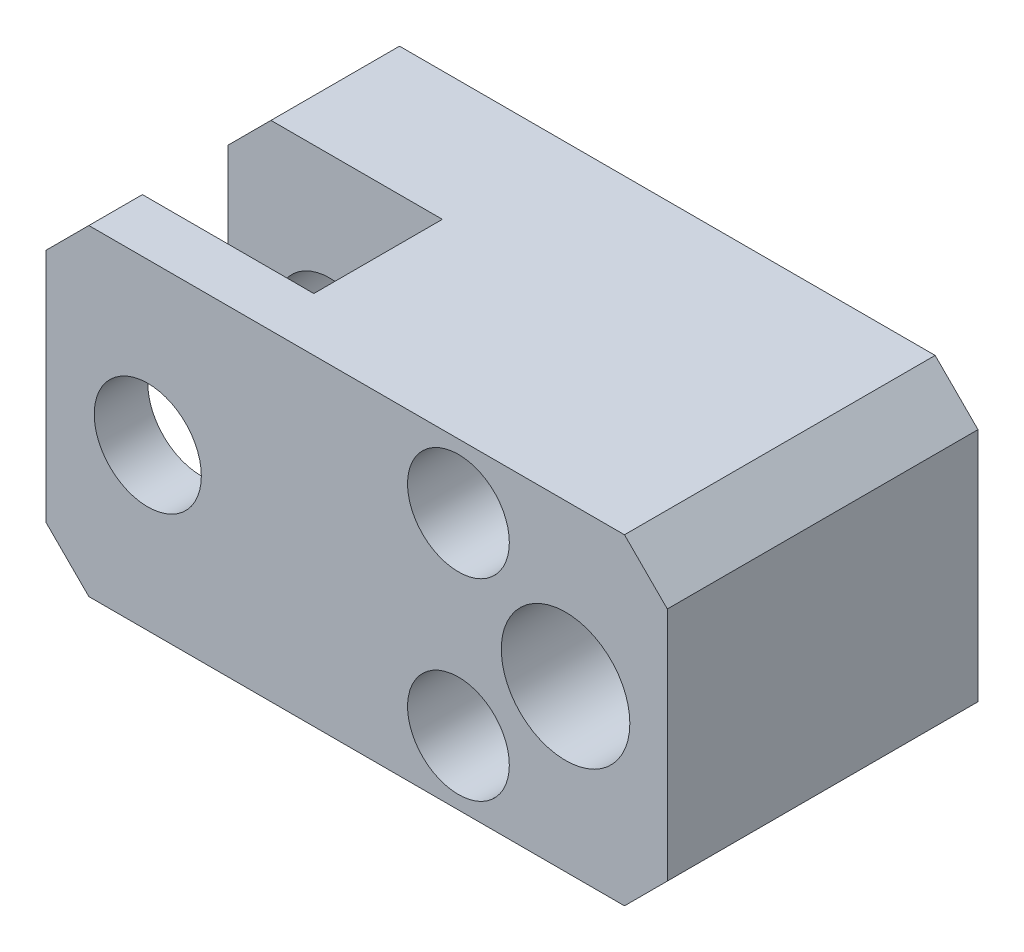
ISO-10303-21;
HEADER;
FILE_DESCRIPTION(('STEP AP214'),'2;1');
FILE_NAME('part.step','',(''),(''),'','','');
FILE_SCHEMA(('AUTOMOTIVE_DESIGN { 1 0 10303 214 1 1 1 1 }'));
ENDSEC;
DATA;
#1=APPLICATION_CONTEXT('core data for automotive mechanical design processes');
#2=APPLICATION_PROTOCOL_DEFINITION('international standard','automotive_design',2000,#1);
#3=PRODUCT_CONTEXT('',#1,'mechanical');
#4=PRODUCT('Part','Part','',(#3));
#5=PRODUCT_RELATED_PRODUCT_CATEGORY('part','',(#4));
#6=PRODUCT_DEFINITION_FORMATION('','',#4);
#7=PRODUCT_DEFINITION_CONTEXT('part definition',#1,'design');
#8=PRODUCT_DEFINITION('design','',#6,#7);
#9=PRODUCT_DEFINITION_SHAPE('','',#8);
#10=(LENGTH_UNIT() NAMED_UNIT(*) SI_UNIT(.MILLI.,.METRE.));
#11=(NAMED_UNIT(*) PLANE_ANGLE_UNIT() SI_UNIT($,.RADIAN.));
#12=(NAMED_UNIT(*) SI_UNIT($,.STERADIAN.) SOLID_ANGLE_UNIT());
#13=UNCERTAINTY_MEASURE_WITH_UNIT(LENGTH_MEASURE(1.E-05),#10,'distance_accuracy_value','');
#14=(GEOMETRIC_REPRESENTATION_CONTEXT(3) GLOBAL_UNCERTAINTY_ASSIGNED_CONTEXT((#13)) GLOBAL_UNIT_ASSIGNED_CONTEXT((#10,
#11,#12)) REPRESENTATION_CONTEXT('',''));
#15=CARTESIAN_POINT('',(0.,0.,0.));
#16=DIRECTION('',(0.,0.,1.));
#17=DIRECTION('',(1.,0.,0.));
#18=AXIS2_PLACEMENT_3D('',#15,#16,#17);
#19=CARTESIAN_POINT('',(-18.5,24.,24.));
#20=DIRECTION('',(1.,0.,0.));
#21=DIRECTION('',(0.,1.,0.));
#22=AXIS2_PLACEMENT_3D('',#19,#20,#21);
#23=PLANE('',#22);
#24=DIRECTION('',(0.,0.,1.));
#25=VECTOR('',#24,1.);
#26=CARTESIAN_POINT('',(-18.5,-6.,24.));
#27=LINE('',#26,#25);
#28=CARTESIAN_POINT('',(-18.5,-6.,12.));
#29=VERTEX_POINT('',#28);
#30=CARTESIAN_POINT('',(-18.5,-6.,24.));
#31=VERTEX_POINT('',#30);
#32=EDGE_CURVE('E129',#29,#31,#27,.T.);
#33=ORIENTED_EDGE('',*,*,#32,.T.);
#34=DIRECTION('',(0.,-1.,0.));
#35=VECTOR('',#34,1.);
#36=CARTESIAN_POINT('',(-18.5,24.,24.));
#37=LINE('',#36,#35);
#38=CARTESIAN_POINT('',(-18.5,24.,24.));
#39=VERTEX_POINT('',#38);
#40=EDGE_CURVE('E137',#39,#31,#37,.T.);
#41=ORIENTED_EDGE('',*,*,#40,.F.);
#42=DIRECTION('',(0.,0.,1.));
#43=VECTOR('',#42,1.);
#44=CARTESIAN_POINT('',(-18.5,24.,24.));
#45=LINE('',#44,#43);
#46=CARTESIAN_POINT('',(-18.5,24.,12.));
#47=VERTEX_POINT('',#46);
#48=EDGE_CURVE('E136',#47,#39,#45,.T.);
#49=ORIENTED_EDGE('',*,*,#48,.F.);
#50=DIRECTION('',(0.,-1.,0.));
#51=VECTOR('',#50,1.);
#52=CARTESIAN_POINT('',(-18.5,24.,12.));
#53=LINE('',#52,#51);
#54=EDGE_CURVE('E121',#47,#29,#53,.T.);
#55=ORIENTED_EDGE('',*,*,#54,.T.);
#56=EDGE_LOOP('',(#33,#41,#49,#55));
#57=FACE_BOUND('',#56,.T.);
#58=ADVANCED_FACE('F14',(#57),#23,.F.);
#59=CARTESIAN_POINT('',(-38.5,24.,0.));
#60=DIRECTION('',(-1.,0.,0.));
#61=DIRECTION('',(0.,-1.,0.));
#62=AXIS2_PLACEMENT_3D('',#59,#60,#61);
#63=PLANE('',#62);
#64=DIRECTION('',(0.,-1.,0.));
#65=VECTOR('',#64,1.);
#66=CARTESIAN_POINT('',(-38.5,-6.,29.));
#67=LINE('',#66,#65);
#68=CARTESIAN_POINT('',(-38.5,20.,29.));
#69=VERTEX_POINT('',#68);
#70=CARTESIAN_POINT('',(-38.5,-2.,29.));
#71=VERTEX_POINT('',#70);
#72=EDGE_CURVE('E164',#69,#71,#67,.T.);
#73=ORIENTED_EDGE('',*,*,#72,.F.);
#74=DIRECTION('',(0.,0.,-1.));
#75=VECTOR('',#74,1.);
#76=CARTESIAN_POINT('',(-38.5,20.,24.));
#77=LINE('',#76,#75);
#78=CARTESIAN_POINT('',(-38.5,20.,24.));
#79=VERTEX_POINT('',#78);
#80=EDGE_CURVE('E36',#69,#79,#77,.T.);
#81=ORIENTED_EDGE('',*,*,#80,.T.);
#82=DIRECTION('',(0.,-1.,0.));
#83=VECTOR('',#82,1.);
#84=CARTESIAN_POINT('',(-38.5,24.,24.));
#85=LINE('',#84,#83);
#86=CARTESIAN_POINT('',(-38.5,-2.,24.));
#87=VERTEX_POINT('',#86);
#88=EDGE_CURVE('E151',#79,#87,#85,.T.);
#89=ORIENTED_EDGE('',*,*,#88,.T.);
#90=DIRECTION('',(0.,0.,1.));
#91=VECTOR('',#90,1.);
#92=CARTESIAN_POINT('',(-38.5,-2.,29.));
#93=LINE('',#92,#91);
#94=EDGE_CURVE('E227',#87,#71,#93,.T.);
#95=ORIENTED_EDGE('',*,*,#94,.T.);
#96=EDGE_LOOP('',(#73,#81,#89,#95));
#97=FACE_BOUND('',#96,.T.);
#98=ADVANCED_FACE('F281',(#97),#63,.T.);
#99=CARTESIAN_POINT('',(19.5,-6.,0.));
#100=DIRECTION('',(0.,0.,1.));
#101=DIRECTION('',(1.,0.,0.));
#102=AXIS2_PLACEMENT_3D('',#99,#100,#101);
#103=PLANE('',#102);
#104=CARTESIAN_POINT('',(0.,18.,0.));
#105=DIRECTION('',(0.,0.,1.));
#106=DIRECTION('',(1.,0.,0.));
#107=AXIS2_PLACEMENT_3D('',#104,#105,#106);
#108=CIRCLE('',#107,2.75);
#109=CARTESIAN_POINT('',(2.75,18.,0.));
#110=VERTEX_POINT('',#109);
#111=EDGE_CURVE('E361',#110,#110,#108,.T.);
#112=ORIENTED_EDGE('',*,*,#111,.T.);
#113=EDGE_LOOP('',(#112));
#114=FACE_BOUND('',#113,.T.);
#115=CARTESIAN_POINT('',(0.,0.,0.));
#116=DIRECTION('',(0.,0.,1.));
#117=DIRECTION('',(1.,0.,0.));
#118=AXIS2_PLACEMENT_3D('',#115,#116,#117);
#119=CIRCLE('',#118,2.75);
#120=CARTESIAN_POINT('',(2.75,0.,0.));
#121=VERTEX_POINT('',#120);
#122=EDGE_CURVE('E349',#121,#121,#119,.T.);
#123=ORIENTED_EDGE('',*,*,#122,.T.);
#124=EDGE_LOOP('',(#123));
#125=FACE_BOUND('',#124,.T.);
#126=DIRECTION('',(-1.,0.,0.));
#127=VECTOR('',#126,1.);
#128=CARTESIAN_POINT('',(19.5,-6.,0.));
#129=LINE('',#128,#127);
#130=CARTESIAN_POINT('',(15.5,-6.,0.));
#131=VERTEX_POINT('',#130);
#132=CARTESIAN_POINT('',(-34.5,-6.,0.));
#133=VERTEX_POINT('',#132);
#134=EDGE_CURVE('E173',#131,#133,#129,.T.);
#135=ORIENTED_EDGE('',*,*,#134,.T.);
#136=DIRECTION('',(-0.707106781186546,0.707106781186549,0.));
#137=VECTOR('',#136,1.);
#138=CARTESIAN_POINT('',(-34.5,-6.,0.));
#139=LINE('',#138,#137);
#140=CARTESIAN_POINT('',(-38.5,-2.,0.));
#141=VERTEX_POINT('',#140);
#142=EDGE_CURVE('E202',#133,#141,#139,.T.);
#143=ORIENTED_EDGE('',*,*,#142,.T.);
#144=DIRECTION('',(0.,1.,0.));
#145=VECTOR('',#144,1.);
#146=CARTESIAN_POINT('',(-38.5,-6.,0.));
#147=LINE('',#146,#145);
#148=CARTESIAN_POINT('',(-38.5,20.,0.));
#149=VERTEX_POINT('',#148);
#150=EDGE_CURVE('E161',#141,#149,#147,.T.);
#151=ORIENTED_EDGE('',*,*,#150,.T.);
#152=DIRECTION('',(0.707106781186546,0.707106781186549,0.));
#153=VECTOR('',#152,1.);
#154=CARTESIAN_POINT('',(-34.5,24.,0.));
#155=LINE('',#154,#153);
#156=CARTESIAN_POINT('',(-34.5,24.,0.));
#157=VERTEX_POINT('',#156);
#158=EDGE_CURVE('E200',#149,#157,#155,.T.);
#159=ORIENTED_EDGE('',*,*,#158,.T.);
#160=DIRECTION('',(-1.,0.,0.));
#161=VECTOR('',#160,1.);
#162=CARTESIAN_POINT('',(19.5,24.,0.));
#163=LINE('',#162,#161);
#164=CARTESIAN_POINT('',(15.5,24.,0.));
#165=VERTEX_POINT('',#164);
#166=EDGE_CURVE('E182',#165,#157,#163,.T.);
#167=ORIENTED_EDGE('',*,*,#166,.F.);
#168=DIRECTION('',(-0.707106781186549,0.707106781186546,0.));
#169=VECTOR('',#168,1.);
#170=CARTESIAN_POINT('',(19.5,20.,0.));
#171=LINE('',#170,#169);
#172=CARTESIAN_POINT('',(19.5,20.,0.));
#173=VERTEX_POINT('',#172);
#174=EDGE_CURVE('E198',#165,#173,#171,.F.);
#175=ORIENTED_EDGE('',*,*,#174,.T.);
#176=DIRECTION('',(0.,1.,0.));
#177=VECTOR('',#176,1.);
#178=CARTESIAN_POINT('',(19.5,-6.,0.));
#179=LINE('',#178,#177);
#180=CARTESIAN_POINT('',(19.5,-2.,0.));
#181=VERTEX_POINT('',#180);
#182=EDGE_CURVE('E167',#181,#173,#179,.T.);
#183=ORIENTED_EDGE('',*,*,#182,.F.);
#184=DIRECTION('',(0.707106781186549,0.707106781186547,0.));
#185=VECTOR('',#184,1.);
#186=CARTESIAN_POINT('',(19.5,-2.,0.));
#187=LINE('',#186,#185);
#188=EDGE_CURVE('E196',#181,#131,#187,.F.);
#189=ORIENTED_EDGE('',*,*,#188,.T.);
#190=EDGE_LOOP('',(#135,#143,#151,#159,#167,#175,#183,#189));
#191=FACE_BOUND('',#190,.T.);
#192=ADVANCED_FACE('F16',(#114,#125,#191),#103,.F.);
#193=CARTESIAN_POINT('',(19.5,24.,29.));
#194=DIRECTION('',(0.,-1.,0.));
#195=DIRECTION('',(0.,0.,-1.));
#196=AXIS2_PLACEMENT_3D('',#193,#194,#195);
#197=PLANE('',#196);
#198=ORIENTED_EDGE('',*,*,#166,.T.);
#199=DIRECTION('',(0.,0.,1.));
#200=VECTOR('',#199,1.);
#201=CARTESIAN_POINT('',(-34.5,24.,12.));
#202=LINE('',#201,#200);
#203=CARTESIAN_POINT('',(-34.5,24.,12.));
#204=VERTEX_POINT('',#203);
#205=EDGE_CURVE('E216',#157,#204,#202,.T.);
#206=ORIENTED_EDGE('',*,*,#205,.T.);
#207=DIRECTION('',(1.,0.,0.));
#208=VECTOR('',#207,1.);
#209=CARTESIAN_POINT('',(-38.5,24.,12.));
#210=LINE('',#209,#208);
#211=EDGE_CURVE('E145',#204,#47,#210,.T.);
#212=ORIENTED_EDGE('',*,*,#211,.T.);
#213=ORIENTED_EDGE('',*,*,#48,.T.);
#214=DIRECTION('',(-1.,0.,0.));
#215=VECTOR('',#214,1.);
#216=CARTESIAN_POINT('',(-38.5,24.,24.));
#217=LINE('',#216,#215);
#218=CARTESIAN_POINT('',(-34.5,24.,24.));
#219=VERTEX_POINT('',#218);
#220=EDGE_CURVE('E142',#39,#219,#217,.T.);
#221=ORIENTED_EDGE('',*,*,#220,.T.);
#222=DIRECTION('',(0.,0.,1.));
#223=VECTOR('',#222,1.);
#224=CARTESIAN_POINT('',(-34.5,24.,29.));
#225=LINE('',#224,#223);
#226=CARTESIAN_POINT('',(-34.5,24.,29.));
#227=VERTEX_POINT('',#226);
#228=EDGE_CURVE('E213',#219,#227,#225,.T.);
#229=ORIENTED_EDGE('',*,*,#228,.T.);
#230=DIRECTION('',(-1.,0.,0.));
#231=VECTOR('',#230,1.);
#232=CARTESIAN_POINT('',(19.5,24.,29.));
#233=LINE('',#232,#231);
#234=CARTESIAN_POINT('',(15.5,24.,29.));
#235=VERTEX_POINT('',#234);
#236=EDGE_CURVE('E179',#235,#227,#233,.T.);
#237=ORIENTED_EDGE('',*,*,#236,.F.);
#238=DIRECTION('',(0.,0.,-1.));
#239=VECTOR('',#238,1.);
#240=CARTESIAN_POINT('',(15.5,24.,29.));
#241=LINE('',#240,#239);
#242=EDGE_CURVE('E211',#235,#165,#241,.T.);
#243=ORIENTED_EDGE('',*,*,#242,.T.);
#244=EDGE_LOOP('',(#198,#206,#212,#213,#221,#229,#237,#243));
#245=FACE_BOUND('',#244,.T.);
#246=ADVANCED_FACE('F314',(#245),#197,.F.);
#247=CARTESIAN_POINT('',(19.5,-6.,29.));
#248=DIRECTION('',(0.,0.,-1.));
#249=DIRECTION('',(-1.,0.,0.));
#250=AXIS2_PLACEMENT_3D('',#247,#248,#249);
#251=PLANE('',#250);
#252=CARTESIAN_POINT('',(0.,18.,29.));
#253=DIRECTION('',(0.,0.,1.));
#254=DIRECTION('',(1.,0.,0.));
#255=AXIS2_PLACEMENT_3D('',#252,#253,#254);
#256=CIRCLE('',#255,4.75);
#257=CARTESIAN_POINT('',(4.75,18.,29.));
#258=VERTEX_POINT('',#257);
#259=EDGE_CURVE('E352',#258,#258,#256,.T.);
#260=ORIENTED_EDGE('',*,*,#259,.F.);
#261=EDGE_LOOP('',(#260));
#262=FACE_BOUND('',#261,.T.);
#263=CARTESIAN_POINT('',(0.,0.,29.));
#264=DIRECTION('',(0.,0.,1.));
#265=DIRECTION('',(1.,0.,0.));
#266=AXIS2_PLACEMENT_3D('',#263,#264,#265);
#267=CIRCLE('',#266,4.75);
#268=CARTESIAN_POINT('',(4.75,0.,29.));
#269=VERTEX_POINT('',#268);
#270=EDGE_CURVE('E340',#269,#269,#267,.T.);
#271=ORIENTED_EDGE('',*,*,#270,.F.);
#272=EDGE_LOOP('',(#271));
#273=FACE_BOUND('',#272,.T.);
#274=CARTESIAN_POINT('',(-29.,9.,29.));
#275=DIRECTION('',(0.,0.,1.));
#276=DIRECTION('',(1.,0.,0.));
#277=AXIS2_PLACEMENT_3D('',#274,#275,#276);
#278=CIRCLE('',#277,5.);
#279=CARTESIAN_POINT('',(-24.,9.,29.));
#280=VERTEX_POINT('',#279);
#281=EDGE_CURVE('E337',#280,#280,#278,.T.);
#282=ORIENTED_EDGE('',*,*,#281,.F.);
#283=EDGE_LOOP('',(#282));
#284=FACE_BOUND('',#283,.T.);
#285=CARTESIAN_POINT('',(10.,9.,29.));
#286=DIRECTION('',(0.,0.,1.));
#287=DIRECTION('',(1.,0.,0.));
#288=AXIS2_PLACEMENT_3D('',#285,#286,#287);
#289=CIRCLE('',#288,6.);
#290=CARTESIAN_POINT('',(16.,9.,29.));
#291=VERTEX_POINT('',#290);
#292=EDGE_CURVE('E152',#291,#291,#289,.T.);
#293=ORIENTED_EDGE('',*,*,#292,.F.);
#294=EDGE_LOOP('',(#293));
#295=FACE_BOUND('',#294,.T.);
#296=ORIENTED_EDGE('',*,*,#236,.T.);
#297=DIRECTION('',(-0.707106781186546,-0.707106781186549,0.));
#298=VECTOR('',#297,1.);
#299=CARTESIAN_POINT('',(-34.5,24.,29.));
#300=LINE('',#299,#298);
#301=EDGE_CURVE('E225',#227,#69,#300,.T.);
#302=ORIENTED_EDGE('',*,*,#301,.T.);
#303=ORIENTED_EDGE('',*,*,#72,.T.);
#304=DIRECTION('',(0.707106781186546,-0.707106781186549,0.));
#305=VECTOR('',#304,1.);
#306=CARTESIAN_POINT('',(-34.5,-6.,29.));
#307=LINE('',#306,#305);
#308=CARTESIAN_POINT('',(-34.5,-6.,29.));
#309=VERTEX_POINT('',#308);
#310=EDGE_CURVE('E223',#71,#309,#307,.T.);
#311=ORIENTED_EDGE('',*,*,#310,.T.);
#312=DIRECTION('',(-1.,0.,0.));
#313=VECTOR('',#312,1.);
#314=CARTESIAN_POINT('',(19.5,-6.,29.));
#315=LINE('',#314,#313);
#316=CARTESIAN_POINT('',(15.5,-6.,29.));
#317=VERTEX_POINT('',#316);
#318=EDGE_CURVE('E176',#317,#309,#315,.T.);
#319=ORIENTED_EDGE('',*,*,#318,.F.);
#320=DIRECTION('',(-0.707106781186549,-0.707106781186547,0.));
#321=VECTOR('',#320,1.);
#322=CARTESIAN_POINT('',(19.5,-2.,29.));
#323=LINE('',#322,#321);
#324=CARTESIAN_POINT('',(19.5,-2.,29.));
#325=VERTEX_POINT('',#324);
#326=EDGE_CURVE('E219',#317,#325,#323,.F.);
#327=ORIENTED_EDGE('',*,*,#326,.T.);
#328=DIRECTION('',(0.,-1.,0.));
#329=VECTOR('',#328,1.);
#330=CARTESIAN_POINT('',(19.5,-6.,29.));
#331=LINE('',#330,#329);
#332=CARTESIAN_POINT('',(19.5,20.,29.));
#333=VERTEX_POINT('',#332);
#334=EDGE_CURVE('E170',#333,#325,#331,.T.);
#335=ORIENTED_EDGE('',*,*,#334,.F.);
#336=DIRECTION('',(0.707106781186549,-0.707106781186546,0.));
#337=VECTOR('',#336,1.);
#338=CARTESIAN_POINT('',(19.5,20.,29.));
#339=LINE('',#338,#337);
#340=EDGE_CURVE('E221',#333,#235,#339,.F.);
#341=ORIENTED_EDGE('',*,*,#340,.T.);
#342=EDGE_LOOP('',(#296,#302,#303,#311,#319,#327,#335,#341));
#343=FACE_BOUND('',#342,.T.);
#344=ADVANCED_FACE('F249',(#262,#273,#284,#295,#343),#251,.F.);
#345=CARTESIAN_POINT('',(19.5,-6.,29.));
#346=DIRECTION('',(0.,1.,0.));
#347=DIRECTION('',(0.,0.,1.));
#348=AXIS2_PLACEMENT_3D('',#345,#346,#347);
#349=PLANE('',#348);
#350=DIRECTION('',(1.,0.,0.));
#351=VECTOR('',#350,1.);
#352=CARTESIAN_POINT('',(-38.5,-6.,12.));
#353=LINE('',#352,#351);
#354=CARTESIAN_POINT('',(-34.5,-6.,12.));
#355=VERTEX_POINT('',#354);
#356=EDGE_CURVE('E116',#355,#29,#353,.T.);
#357=ORIENTED_EDGE('',*,*,#356,.F.);
#358=DIRECTION('',(0.,0.,-1.));
#359=VECTOR('',#358,1.);
#360=CARTESIAN_POINT('',(-34.5,-6.,0.));
#361=LINE('',#360,#359);
#362=EDGE_CURVE('E194',#355,#133,#361,.T.);
#363=ORIENTED_EDGE('',*,*,#362,.T.);
#364=ORIENTED_EDGE('',*,*,#134,.F.);
#365=DIRECTION('',(0.,0.,1.));
#366=VECTOR('',#365,1.);
#367=CARTESIAN_POINT('',(15.5,-6.,29.));
#368=LINE('',#367,#366);
#369=EDGE_CURVE('E185',#131,#317,#368,.T.);
#370=ORIENTED_EDGE('',*,*,#369,.T.);
#371=ORIENTED_EDGE('',*,*,#318,.T.);
#372=DIRECTION('',(0.,0.,-1.));
#373=VECTOR('',#372,1.);
#374=CARTESIAN_POINT('',(-34.5,-6.,24.));
#375=LINE('',#374,#373);
#376=CARTESIAN_POINT('',(-34.5,-6.,24.));
#377=VERTEX_POINT('',#376);
#378=EDGE_CURVE('E192',#309,#377,#375,.T.);
#379=ORIENTED_EDGE('',*,*,#378,.T.);
#380=DIRECTION('',(-1.,0.,0.));
#381=VECTOR('',#380,1.);
#382=CARTESIAN_POINT('',(-38.5,-6.,24.));
#383=LINE('',#382,#381);
#384=EDGE_CURVE('E130',#31,#377,#383,.T.);
#385=ORIENTED_EDGE('',*,*,#384,.F.);
#386=ORIENTED_EDGE('',*,*,#32,.F.);
#387=EDGE_LOOP('',(#357,#363,#364,#370,#371,#379,#385,#386));
#388=FACE_BOUND('',#387,.T.);
#389=ADVANCED_FACE('F140',(#388),#349,.F.);
#390=CARTESIAN_POINT('',(19.5,24.,0.));
#391=DIRECTION('',(-1.,0.,0.));
#392=DIRECTION('',(0.,-1.,0.));
#393=AXIS2_PLACEMENT_3D('',#390,#391,#392);
#394=PLANE('',#393);
#395=ORIENTED_EDGE('',*,*,#182,.T.);
#396=DIRECTION('',(0.,0.,1.));
#397=VECTOR('',#396,1.);
#398=CARTESIAN_POINT('',(19.5,20.,0.));
#399=LINE('',#398,#397);
#400=EDGE_CURVE('E9',#173,#333,#399,.T.);
#401=ORIENTED_EDGE('',*,*,#400,.T.);
#402=ORIENTED_EDGE('',*,*,#334,.T.);
#403=DIRECTION('',(0.,0.,-1.));
#404=VECTOR('',#403,1.);
#405=CARTESIAN_POINT('',(19.5,-2.,0.));
#406=LINE('',#405,#404);
#407=EDGE_CURVE('E22',#325,#181,#406,.T.);
#408=ORIENTED_EDGE('',*,*,#407,.T.);
#409=EDGE_LOOP('',(#395,#401,#402,#408));
#410=FACE_BOUND('',#409,.T.);
#411=ADVANCED_FACE('F236',(#410),#394,.F.);
#412=ORIENTED_EDGE('',*,*,#150,.F.);
#413=DIRECTION('',(0.,0.,1.));
#414=VECTOR('',#413,1.);
#415=CARTESIAN_POINT('',(-38.5,-2.,12.));
#416=LINE('',#415,#414);
#417=CARTESIAN_POINT('',(-38.5,-2.,12.));
#418=VERTEX_POINT('',#417);
#419=EDGE_CURVE('E206',#141,#418,#416,.T.);
#420=ORIENTED_EDGE('',*,*,#419,.T.);
#421=DIRECTION('',(0.,-1.,0.));
#422=VECTOR('',#421,1.);
#423=CARTESIAN_POINT('',(-38.5,24.,12.));
#424=LINE('',#423,#422);
#425=CARTESIAN_POINT('',(-38.5,20.,12.));
#426=VERTEX_POINT('',#425);
#427=EDGE_CURVE('E138',#426,#418,#424,.T.);
#428=ORIENTED_EDGE('',*,*,#427,.F.);
#429=DIRECTION('',(0.,0.,-1.));
#430=VECTOR('',#429,1.);
#431=CARTESIAN_POINT('',(-38.5,20.,0.));
#432=LINE('',#431,#430);
#433=EDGE_CURVE('E204',#426,#149,#432,.T.);
#434=ORIENTED_EDGE('',*,*,#433,.T.);
#435=EDGE_LOOP('',(#412,#420,#428,#434));
#436=FACE_BOUND('',#435,.T.);
#437=ADVANCED_FACE('F260',(#436),#63,.T.);
#438=CARTESIAN_POINT('',(10.,9.,6.));
#439=DIRECTION('',(0.,0.,1.));
#440=DIRECTION('',(1.,0.,0.));
#441=AXIS2_PLACEMENT_3D('',#438,#439,#440);
#442=CYLINDRICAL_SURFACE('',#441,6.);
#443=CARTESIAN_POINT('',(10.,9.,6.));
#444=DIRECTION('',(0.,0.,1.));
#445=DIRECTION('',(1.,0.,0.));
#446=AXIS2_PLACEMENT_3D('',#443,#444,#445);
#447=CIRCLE('',#446,6.);
#448=CARTESIAN_POINT('',(16.,9.,6.));
#449=VERTEX_POINT('',#448);
#450=EDGE_CURVE('E158',#449,#449,#447,.T.);
#451=ORIENTED_EDGE('',*,*,#450,.F.);
#452=EDGE_LOOP('',(#451));
#453=FACE_BOUND('',#452,.T.);
#454=ORIENTED_EDGE('',*,*,#292,.T.);
#455=EDGE_LOOP('',(#454));
#456=FACE_BOUND('',#455,.T.);
#457=ADVANCED_FACE('F303',(#453,#456),#442,.F.);
#458=CARTESIAN_POINT('',(10.,9.,6.));
#459=DIRECTION('',(0.,0.,1.));
#460=DIRECTION('',(1.,0.,0.));
#461=AXIS2_PLACEMENT_3D('',#458,#459,#460);
#462=PLANE('',#461);
#463=ORIENTED_EDGE('',*,*,#450,.T.);
#464=EDGE_LOOP('',(#463));
#465=FACE_BOUND('',#464,.T.);
#466=ADVANCED_FACE('F299',(#465),#462,.T.);
#467=CARTESIAN_POINT('',(-38.5,24.,24.));
#468=DIRECTION('',(0.,0.,1.));
#469=DIRECTION('',(0.,-1.,0.));
#470=AXIS2_PLACEMENT_3D('',#467,#468,#469);
#471=PLANE('',#470);
#472=CARTESIAN_POINT('',(-29.,9.,24.));
#473=DIRECTION('',(0.,0.,1.));
#474=DIRECTION('',(0.,-1.,0.));
#475=AXIS2_PLACEMENT_3D('',#472,#473,#474);
#476=CIRCLE('',#475,5.);
#477=CARTESIAN_POINT('',(-29.,4.,24.));
#478=VERTEX_POINT('',#477);
#479=EDGE_CURVE('E189',#478,#478,#476,.T.);
#480=ORIENTED_EDGE('',*,*,#479,.T.);
#481=EDGE_LOOP('',(#480));
#482=FACE_BOUND('',#481,.T.);
#483=ORIENTED_EDGE('',*,*,#88,.F.);
#484=DIRECTION('',(0.707106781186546,0.707106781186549,0.));
#485=VECTOR('',#484,1.);
#486=CARTESIAN_POINT('',(-34.5,24.,24.));
#487=LINE('',#486,#485);
#488=EDGE_CURVE('E231',#79,#219,#487,.T.);
#489=ORIENTED_EDGE('',*,*,#488,.T.);
#490=ORIENTED_EDGE('',*,*,#220,.F.);
#491=ORIENTED_EDGE('',*,*,#40,.T.);
#492=ORIENTED_EDGE('',*,*,#384,.T.);
#493=DIRECTION('',(-0.707106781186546,0.707106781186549,0.));
#494=VECTOR('',#493,1.);
#495=CARTESIAN_POINT('',(-34.5,-6.,24.));
#496=LINE('',#495,#494);
#497=EDGE_CURVE('E29',#377,#87,#496,.T.);
#498=ORIENTED_EDGE('',*,*,#497,.T.);
#499=EDGE_LOOP('',(#483,#489,#490,#491,#492,#498));
#500=FACE_BOUND('',#499,.T.);
#501=ADVANCED_FACE('F295',(#482,#500),#471,.F.);
#502=CARTESIAN_POINT('',(-38.5,24.,12.));
#503=DIRECTION('',(0.,0.,-1.));
#504=DIRECTION('',(0.,1.,0.));
#505=AXIS2_PLACEMENT_3D('',#502,#503,#504);
#506=PLANE('',#505);
#507=CARTESIAN_POINT('',(-29.,9.,12.));
#508=DIRECTION('',(0.,0.,-1.));
#509=DIRECTION('',(0.,1.,0.));
#510=AXIS2_PLACEMENT_3D('',#507,#508,#509);
#511=CIRCLE('',#510,5.);
#512=CARTESIAN_POINT('',(-29.,14.,12.));
#513=VERTEX_POINT('',#512);
#514=EDGE_CURVE('E186',#513,#513,#511,.T.);
#515=ORIENTED_EDGE('',*,*,#514,.T.);
#516=EDGE_LOOP('',(#515));
#517=FACE_BOUND('',#516,.T.);
#518=ORIENTED_EDGE('',*,*,#427,.T.);
#519=DIRECTION('',(0.707106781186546,-0.707106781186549,0.));
#520=VECTOR('',#519,1.);
#521=CARTESIAN_POINT('',(-34.5,-6.,12.));
#522=LINE('',#521,#520);
#523=EDGE_CURVE('E124',#418,#355,#522,.T.);
#524=ORIENTED_EDGE('',*,*,#523,.T.);
#525=ORIENTED_EDGE('',*,*,#356,.T.);
#526=ORIENTED_EDGE('',*,*,#54,.F.);
#527=ORIENTED_EDGE('',*,*,#211,.F.);
#528=DIRECTION('',(-0.707106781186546,-0.707106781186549,0.));
#529=VECTOR('',#528,1.);
#530=CARTESIAN_POINT('',(-34.5,24.,12.));
#531=LINE('',#530,#529);
#532=EDGE_CURVE('E208',#204,#426,#531,.T.);
#533=ORIENTED_EDGE('',*,*,#532,.T.);
#534=EDGE_LOOP('',(#518,#524,#525,#526,#527,#533));
#535=FACE_BOUND('',#534,.T.);
#536=ADVANCED_FACE('F119',(#517,#535),#506,.F.);
#537=CARTESIAN_POINT('',(-29.,9.,6.5));
#538=DIRECTION('',(0.,0.,1.));
#539=DIRECTION('',(1.,0.,0.));
#540=AXIS2_PLACEMENT_3D('',#537,#538,#539);
#541=PLANE('',#540);
#542=CARTESIAN_POINT('',(-29.,9.,6.5));
#543=DIRECTION('',(0.,0.,1.));
#544=DIRECTION('',(1.,0.,0.));
#545=AXIS2_PLACEMENT_3D('',#542,#543,#544);
#546=CIRCLE('',#545,5.);
#547=CARTESIAN_POINT('',(-24.,9.,6.5));
#548=VERTEX_POINT('',#547);
#549=EDGE_CURVE('E190',#548,#548,#546,.T.);
#550=ORIENTED_EDGE('',*,*,#549,.T.);
#551=EDGE_LOOP('',(#550));
#552=FACE_BOUND('',#551,.T.);
#553=ADVANCED_FACE('F294',(#552),#541,.T.);
#554=CARTESIAN_POINT('',(-29.,9.,6.5));
#555=DIRECTION('',(0.,0.,1.));
#556=DIRECTION('',(1.,0.,0.));
#557=AXIS2_PLACEMENT_3D('',#554,#555,#556);
#558=CYLINDRICAL_SURFACE('',#557,5.);
#559=ORIENTED_EDGE('',*,*,#549,.F.);
#560=EDGE_LOOP('',(#559));
#561=FACE_BOUND('',#560,.T.);
#562=ORIENTED_EDGE('',*,*,#514,.F.);
#563=EDGE_LOOP('',(#562));
#564=FACE_BOUND('',#563,.T.);
#565=ADVANCED_FACE('F390',(#561,#564),#558,.F.);
#566=ORIENTED_EDGE('',*,*,#281,.T.);
#567=EDGE_LOOP('',(#566));
#568=FACE_BOUND('',#567,.T.);
#569=ORIENTED_EDGE('',*,*,#479,.F.);
#570=EDGE_LOOP('',(#569));
#571=FACE_BOUND('',#570,.T.);
#572=ADVANCED_FACE('F290',(#568,#571),#558,.F.);
#573=CARTESIAN_POINT('',(0.,0.,29.));
#574=DIRECTION('',(0.,0.,1.));
#575=DIRECTION('',(1.,0.,0.));
#576=AXIS2_PLACEMENT_3D('',#573,#574,#575);
#577=CYLINDRICAL_SURFACE('',#576,4.75);
#578=CARTESIAN_POINT('',(0.,0.,22.));
#579=DIRECTION('',(0.,0.,1.));
#580=DIRECTION('',(1.,0.,0.));
#581=AXIS2_PLACEMENT_3D('',#578,#579,#580);
#582=CIRCLE('',#581,4.75);
#583=CARTESIAN_POINT('',(4.75,0.,22.));
#584=VERTEX_POINT('',#583);
#585=EDGE_CURVE('E343',#584,#584,#582,.T.);
#586=ORIENTED_EDGE('',*,*,#585,.F.);
#587=EDGE_LOOP('',(#586));
#588=FACE_BOUND('',#587,.T.);
#589=ORIENTED_EDGE('',*,*,#270,.T.);
#590=EDGE_LOOP('',(#589));
#591=FACE_BOUND('',#590,.T.);
#592=ADVANCED_FACE('F389',(#588,#591),#577,.F.);
#593=CARTESIAN_POINT('',(0.,2.75,22.));
#594=DIRECTION('',(0.,0.,-1.));
#595=DIRECTION('',(-1.,0.,0.));
#596=AXIS2_PLACEMENT_3D('',#593,#594,#595);
#597=PLANE('',#596);
#598=CARTESIAN_POINT('',(0.,0.,22.));
#599=DIRECTION('',(0.,0.,1.));
#600=DIRECTION('',(1.,0.,0.));
#601=AXIS2_PLACEMENT_3D('',#598,#599,#600);
#602=CIRCLE('',#601,2.75);
#603=CARTESIAN_POINT('',(2.75,0.,22.));
#604=VERTEX_POINT('',#603);
#605=EDGE_CURVE('E346',#604,#604,#602,.T.);
#606=ORIENTED_EDGE('',*,*,#605,.F.);
#607=EDGE_LOOP('',(#606));
#608=FACE_BOUND('',#607,.T.);
#609=ORIENTED_EDGE('',*,*,#585,.T.);
#610=EDGE_LOOP('',(#609));
#611=FACE_BOUND('',#610,.T.);
#612=ADVANCED_FACE('F397',(#608,#611),#597,.F.);
#613=CARTESIAN_POINT('',(0.,0.,29.));
#614=DIRECTION('',(0.,0.,1.));
#615=DIRECTION('',(1.,0.,0.));
#616=AXIS2_PLACEMENT_3D('',#613,#614,#615);
#617=CYLINDRICAL_SURFACE('',#616,2.75);
#618=ORIENTED_EDGE('',*,*,#122,.F.);
#619=EDGE_LOOP('',(#618));
#620=FACE_BOUND('',#619,.T.);
#621=ORIENTED_EDGE('',*,*,#605,.T.);
#622=EDGE_LOOP('',(#621));
#623=FACE_BOUND('',#622,.T.);
#624=ADVANCED_FACE('F376',(#620,#623),#617,.F.);
#625=CARTESIAN_POINT('',(0.,18.,29.));
#626=DIRECTION('',(0.,0.,1.));
#627=DIRECTION('',(1.,0.,0.));
#628=AXIS2_PLACEMENT_3D('',#625,#626,#627);
#629=CYLINDRICAL_SURFACE('',#628,4.75);
#630=CARTESIAN_POINT('',(0.,18.,22.));
#631=DIRECTION('',(0.,0.,1.));
#632=DIRECTION('',(1.,0.,0.));
#633=AXIS2_PLACEMENT_3D('',#630,#631,#632);
#634=CIRCLE('',#633,4.75);
#635=CARTESIAN_POINT('',(4.75,18.,22.));
#636=VERTEX_POINT('',#635);
#637=EDGE_CURVE('E355',#636,#636,#634,.T.);
#638=ORIENTED_EDGE('',*,*,#637,.F.);
#639=EDGE_LOOP('',(#638));
#640=FACE_BOUND('',#639,.T.);
#641=ORIENTED_EDGE('',*,*,#259,.T.);
#642=EDGE_LOOP('',(#641));
#643=FACE_BOUND('',#642,.T.);
#644=ADVANCED_FACE('F370',(#640,#643),#629,.F.);
#645=CARTESIAN_POINT('',(0.,20.75,22.));
#646=DIRECTION('',(0.,0.,-1.));
#647=DIRECTION('',(-1.,0.,0.));
#648=AXIS2_PLACEMENT_3D('',#645,#646,#647);
#649=PLANE('',#648);
#650=CARTESIAN_POINT('',(0.,18.,22.));
#651=DIRECTION('',(0.,0.,1.));
#652=DIRECTION('',(1.,0.,0.));
#653=AXIS2_PLACEMENT_3D('',#650,#651,#652);
#654=CIRCLE('',#653,2.75);
#655=CARTESIAN_POINT('',(2.75,18.,22.));
#656=VERTEX_POINT('',#655);
#657=EDGE_CURVE('E358',#656,#656,#654,.T.);
#658=ORIENTED_EDGE('',*,*,#657,.F.);
#659=EDGE_LOOP('',(#658));
#660=FACE_BOUND('',#659,.T.);
#661=ORIENTED_EDGE('',*,*,#637,.T.);
#662=EDGE_LOOP('',(#661));
#663=FACE_BOUND('',#662,.T.);
#664=ADVANCED_FACE('F277',(#660,#663),#649,.F.);
#665=CARTESIAN_POINT('',(0.,18.,29.));
#666=DIRECTION('',(0.,0.,1.));
#667=DIRECTION('',(1.,0.,0.));
#668=AXIS2_PLACEMENT_3D('',#665,#666,#667);
#669=CYLINDRICAL_SURFACE('',#668,2.75);
#670=ORIENTED_EDGE('',*,*,#111,.F.);
#671=EDGE_LOOP('',(#670));
#672=FACE_BOUND('',#671,.T.);
#673=ORIENTED_EDGE('',*,*,#657,.T.);
#674=EDGE_LOOP('',(#673));
#675=FACE_BOUND('',#674,.T.);
#676=ADVANCED_FACE('F266',(#672,#675),#669,.F.);
#677=CARTESIAN_POINT('',(-34.5,-6.,29.));
#678=DIRECTION('',(-0.707106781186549,-0.707106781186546,0.));
#679=DIRECTION('',(0.707106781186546,-0.707106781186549,0.));
#680=AXIS2_PLACEMENT_3D('',#677,#678,#679);
#681=PLANE('',#680);
#682=ORIENTED_EDGE('',*,*,#523,.F.);
#683=ORIENTED_EDGE('',*,*,#419,.F.);
#684=ORIENTED_EDGE('',*,*,#142,.F.);
#685=ORIENTED_EDGE('',*,*,#362,.F.);
#686=EDGE_LOOP('',(#682,#683,#684,#685));
#687=FACE_BOUND('',#686,.T.);
#688=ADVANCED_FACE('F263',(#687),#681,.T.);
#689=CARTESIAN_POINT('',(-34.5,24.,29.));
#690=DIRECTION('',(-0.707106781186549,0.707106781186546,0.));
#691=DIRECTION('',(-0.707106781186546,-0.707106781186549,0.));
#692=AXIS2_PLACEMENT_3D('',#689,#690,#691);
#693=PLANE('',#692);
#694=ORIENTED_EDGE('',*,*,#158,.F.);
#695=ORIENTED_EDGE('',*,*,#433,.F.);
#696=ORIENTED_EDGE('',*,*,#532,.F.);
#697=ORIENTED_EDGE('',*,*,#205,.F.);
#698=EDGE_LOOP('',(#694,#695,#696,#697));
#699=FACE_BOUND('',#698,.T.);
#700=ADVANCED_FACE('F265',(#699),#693,.T.);
#701=CARTESIAN_POINT('',(-34.5,24.,29.));
#702=DIRECTION('',(-0.707106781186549,0.707106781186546,0.));
#703=DIRECTION('',(-0.707106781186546,-0.707106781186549,0.));
#704=AXIS2_PLACEMENT_3D('',#701,#702,#703);
#705=PLANE('',#704);
#706=ORIENTED_EDGE('',*,*,#488,.F.);
#707=ORIENTED_EDGE('',*,*,#80,.F.);
#708=ORIENTED_EDGE('',*,*,#301,.F.);
#709=ORIENTED_EDGE('',*,*,#228,.F.);
#710=EDGE_LOOP('',(#706,#707,#708,#709));
#711=FACE_BOUND('',#710,.T.);
#712=ADVANCED_FACE('F274',(#711),#705,.T.);
#713=CARTESIAN_POINT('',(-34.5,-6.,29.));
#714=DIRECTION('',(-0.707106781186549,-0.707106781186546,0.));
#715=DIRECTION('',(0.707106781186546,-0.707106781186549,0.));
#716=AXIS2_PLACEMENT_3D('',#713,#714,#715);
#717=PLANE('',#716);
#718=ORIENTED_EDGE('',*,*,#310,.F.);
#719=ORIENTED_EDGE('',*,*,#94,.F.);
#720=ORIENTED_EDGE('',*,*,#497,.F.);
#721=ORIENTED_EDGE('',*,*,#378,.F.);
#722=EDGE_LOOP('',(#718,#719,#720,#721));
#723=FACE_BOUND('',#722,.T.);
#724=ADVANCED_FACE('F331',(#723),#717,.T.);
#725=CARTESIAN_POINT('',(19.5,20.,0.));
#726=DIRECTION('',(-0.707106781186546,-0.707106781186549,0.));
#727=DIRECTION('',(0.707106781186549,-0.707106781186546,0.));
#728=AXIS2_PLACEMENT_3D('',#725,#726,#727);
#729=PLANE('',#728);
#730=ORIENTED_EDGE('',*,*,#174,.F.);
#731=ORIENTED_EDGE('',*,*,#242,.F.);
#732=ORIENTED_EDGE('',*,*,#340,.F.);
#733=ORIENTED_EDGE('',*,*,#400,.F.);
#734=EDGE_LOOP('',(#730,#731,#732,#733));
#735=FACE_BOUND('',#734,.T.);
#736=ADVANCED_FACE('F247',(#735),#729,.F.);
#737=CARTESIAN_POINT('',(19.5,-2.,0.));
#738=DIRECTION('',(-0.707106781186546,0.707106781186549,0.));
#739=DIRECTION('',(-0.707106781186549,-0.707106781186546,0.));
#740=AXIS2_PLACEMENT_3D('',#737,#738,#739);
#741=PLANE('',#740);
#742=ORIENTED_EDGE('',*,*,#326,.F.);
#743=ORIENTED_EDGE('',*,*,#369,.F.);
#744=ORIENTED_EDGE('',*,*,#188,.F.);
#745=ORIENTED_EDGE('',*,*,#407,.F.);
#746=EDGE_LOOP('',(#742,#743,#744,#745));
#747=FACE_BOUND('',#746,.T.);
#748=ADVANCED_FACE('F253',(#747),#741,.F.);
#749=CLOSED_SHELL('',(#58,#98,#192,#246,#344,#389,#411,#437,#457,#466,#501,#536,#553,#565,#572,
#592,#612,#624,#644,#664,#676,#688,#700,#712,#724,#736,#748));
#750=MANIFOLD_SOLID_BREP('B1',#749);
#751=ADVANCED_BREP_SHAPE_REPRESENTATION('',(#18,#750),#14);
#752=SHAPE_DEFINITION_REPRESENTATION(#9,#751);
ENDSEC;
END-ISO-10303-21;
